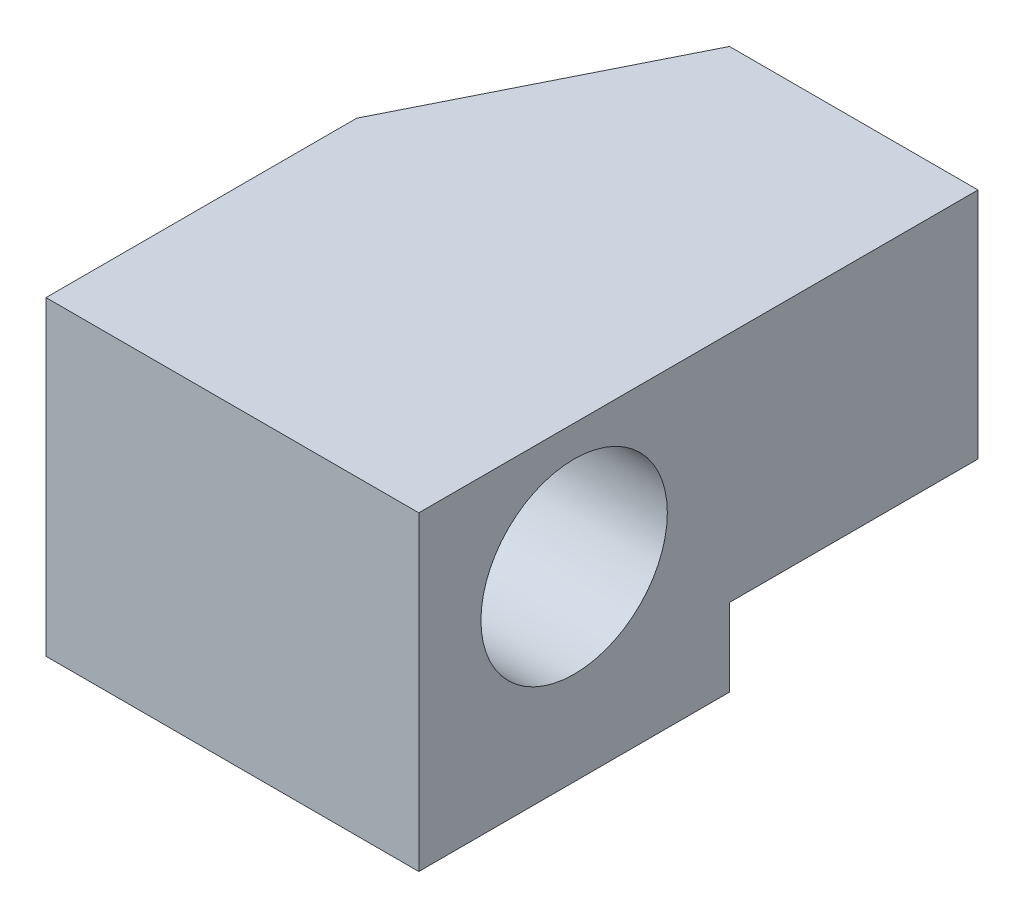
from build123d import *

# Parameters (mm, degrees)
SKICA1_W        = 120
SKICA1_H        = 100
VYSUNOUT1_DEPTH = 100
VYSUNOUT2_DEPTH = 75
VYSUNOUT3_REACH = 166.012
SKICA3_R        = 30


with BuildPart() as part:
    # Skica1 → Vysunout1 (new body)
    with BuildSketch(Plane.XY):
        Rectangle(SKICA1_W, SKICA1_H)
    extrude(amount=VYSUNOUT1_DEPTH)

    # Skica2 → Vysunout2 (add)
    with BuildSketch(Plane(origin=(0, 50, 0), x_dir=(1, 0, 0), z_dir=(0, 1, 0))):
        Polygon((-60, 0), (-20, 80), (60, 80), (60, 0), align=None)
    extrude(amount=-VYSUNOUT2_DEPTH)

    # Skica3 → Vysunout3 (cut, up to next)
    with BuildSketch(Plane.ZY.offset(60), mode=Mode.PRIVATE) as vysunout3_sk1:
        with Locations(Location((50, 10, 0), (0, 0, 270))):
            Circle(SKICA3_R)
    vysunout3_tool1 = extrude(vysunout3_sk1.sketch, amount=-VYSUNOUT3_REACH, mode=Mode.PRIVATE) & part.part
    add(vysunout3_tool1.solids().sort_by_distance((-60, 10, 50))[0], mode=Mode.SUBTRACT)


solid = part.part
